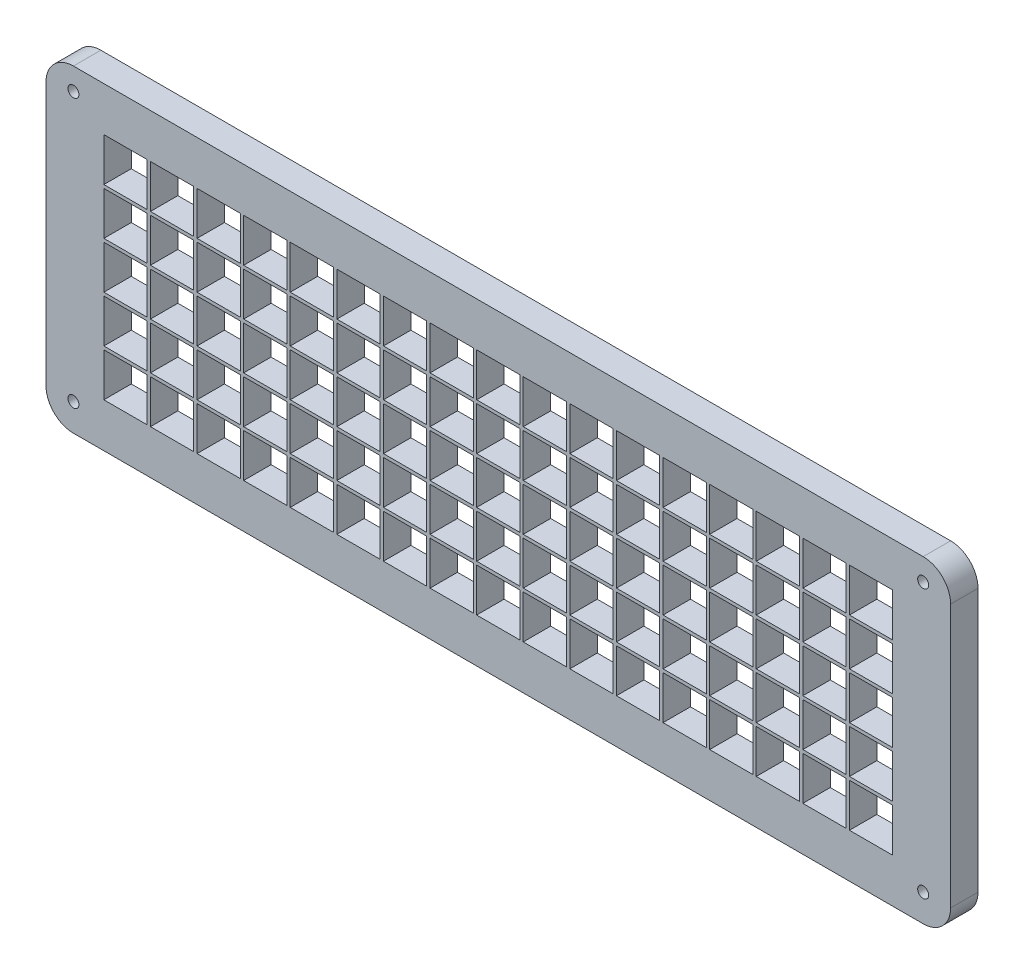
from build123d import *

# Parameters (mm, degrees)
SKETCH_1_W          = 330
SKETCH_1_H          = 116
EXTRUDE_1_DEPTH     = 10
SKETCH_2_W          = 15.8
SKETCH_2_H          = 15.8
CUT_EXTRUDE_3_DEPTH = 176.182761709
FILLET_2_R          = 10
CUT_EXTRUDE_4_DEPTH = 176.182761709


with BuildPart() as part:
    # Sketch 1 → Extrude 1 (new body)
    with BuildSketch(Plane.XY):
        Rectangle(SKETCH_1_W, SKETCH_1_H)
    extrude(amount=EXTRUDE_1_DEPTH)

    # Sketch 2 → Cut-Extrude 3 (cut, through all)
    with BuildSketch(Plane.XY.offset(10)):
        with Locations((-17, 0)):
            Rectangle(SKETCH_2_W, SKETCH_2_H)
        Rectangle(SKETCH_2_W, SKETCH_2_H)
        with Locations((-34, 0)):
            Rectangle(SKETCH_2_W, SKETCH_2_H)
        with Locations((-51, 0)):
            Rectangle(SKETCH_2_W, SKETCH_2_H)
        with Locations((-68, 0)):
            Rectangle(SKETCH_2_W, SKETCH_2_H)
        with Locations((-85, 0)):
            Rectangle(SKETCH_2_W, SKETCH_2_H)
        with Locations((-102, 0)):
            Rectangle(SKETCH_2_W, SKETCH_2_H)
        with Locations((-119, 0)):
            Rectangle(SKETCH_2_W, SKETCH_2_H)
        with Locations((-136, 0)):
            Rectangle(SKETCH_2_W, SKETCH_2_H)
        with Locations((17, 0)):
            Rectangle(SKETCH_2_W, SKETCH_2_H)
        with Locations((34, 0)):
            Rectangle(SKETCH_2_W, SKETCH_2_H)
        with Locations((51, 0)):
            Rectangle(SKETCH_2_W, SKETCH_2_H)
        with Locations((68, 0)):
            Rectangle(SKETCH_2_W, SKETCH_2_H)
        with Locations((85, 0)):
            Rectangle(SKETCH_2_W, SKETCH_2_H)
        with Locations((102, 0)):
            Rectangle(SKETCH_2_W, SKETCH_2_H)
        with Locations((119, 0)):
            Rectangle(SKETCH_2_W, SKETCH_2_H)
        with Locations((136, 0)):
            Rectangle(SKETCH_2_W, SKETCH_2_H)
        with Locations((-17, 17)):
            Rectangle(SKETCH_2_W, SKETCH_2_H)
        with Locations((0, 17)):
            Rectangle(SKETCH_2_W, SKETCH_2_H)
        with Locations((-34, 17)):
            Rectangle(SKETCH_2_W, SKETCH_2_H)
        with Locations((-51, 17)):
            Rectangle(SKETCH_2_W, SKETCH_2_H)
        with Locations((-68, 17)):
            Rectangle(SKETCH_2_W, SKETCH_2_H)
        with Locations((-85, 17)):
            Rectangle(SKETCH_2_W, SKETCH_2_H)
        with Locations((-102, 17)):
            Rectangle(SKETCH_2_W, SKETCH_2_H)
        with Locations((-119, 17)):
            Rectangle(SKETCH_2_W, SKETCH_2_H)
        with Locations((-136, 17)):
            Rectangle(SKETCH_2_W, SKETCH_2_H)
        with Locations((17, 17)):
            Rectangle(SKETCH_2_W, SKETCH_2_H)
        with Locations((34, 17)):
            Rectangle(SKETCH_2_W, SKETCH_2_H)
        with Locations((51, 17)):
            Rectangle(SKETCH_2_W, SKETCH_2_H)
        with Locations((68, 17)):
            Rectangle(SKETCH_2_W, SKETCH_2_H)
        with Locations((85, 17)):
            Rectangle(SKETCH_2_W, SKETCH_2_H)
        with Locations((102, 17)):
            Rectangle(SKETCH_2_W, SKETCH_2_H)
        with Locations((119, 17)):
            Rectangle(SKETCH_2_W, SKETCH_2_H)
        with Locations((136, 17)):
            Rectangle(SKETCH_2_W, SKETCH_2_H)
        with Locations((-17, 34)):
            Rectangle(SKETCH_2_W, SKETCH_2_H)
        with Locations((0, 34)):
            Rectangle(SKETCH_2_W, SKETCH_2_H)
        with Locations((-34, 34)):
            Rectangle(SKETCH_2_W, SKETCH_2_H)
        with Locations((-51, 34)):
            Rectangle(SKETCH_2_W, SKETCH_2_H)
        with Locations((-68, 34)):
            Rectangle(SKETCH_2_W, SKETCH_2_H)
        with Locations((-85, 34)):
            Rectangle(SKETCH_2_W, SKETCH_2_H)
        with Locations((-102, 34)):
            Rectangle(SKETCH_2_W, SKETCH_2_H)
        with Locations((-119, 34)):
            Rectangle(SKETCH_2_W, SKETCH_2_H)
        with Locations((-136, 34)):
            Rectangle(SKETCH_2_W, SKETCH_2_H)
        with Locations((17, 34)):
            Rectangle(SKETCH_2_W, SKETCH_2_H)
        with Locations((34, 34)):
            Rectangle(SKETCH_2_W, SKETCH_2_H)
        with Locations((51, 34)):
            Rectangle(SKETCH_2_W, SKETCH_2_H)
        with Locations((68, 34)):
            Rectangle(SKETCH_2_W, SKETCH_2_H)
        with Locations((85, 34)):
            Rectangle(SKETCH_2_W, SKETCH_2_H)
        with Locations((102, 34)):
            Rectangle(SKETCH_2_W, SKETCH_2_H)
        with Locations((119, 34)):
            Rectangle(SKETCH_2_W, SKETCH_2_H)
        with Locations((136, 34)):
            Rectangle(SKETCH_2_W, SKETCH_2_H)
        with Locations((-17, -17)):
            Rectangle(SKETCH_2_W, SKETCH_2_H)
        with Locations((0, -17)):
            Rectangle(SKETCH_2_W, SKETCH_2_H)
        with Locations((-34, -17)):
            Rectangle(SKETCH_2_W, SKETCH_2_H)
        with Locations((-51, -17)):
            Rectangle(SKETCH_2_W, SKETCH_2_H)
        with Locations((-68, -17)):
            Rectangle(SKETCH_2_W, SKETCH_2_H)
        with Locations((-85, -17)):
            Rectangle(SKETCH_2_W, SKETCH_2_H)
        with Locations((-102, -17)):
            Rectangle(SKETCH_2_W, SKETCH_2_H)
        with Locations((-119, -17)):
            Rectangle(SKETCH_2_W, SKETCH_2_H)
        with Locations((-136, -17)):
            Rectangle(SKETCH_2_W, SKETCH_2_H)
        with Locations((17, -17)):
            Rectangle(SKETCH_2_W, SKETCH_2_H)
        with Locations((34, -17)):
            Rectangle(SKETCH_2_W, SKETCH_2_H)
        with Locations((51, -17)):
            Rectangle(SKETCH_2_W, SKETCH_2_H)
        with Locations((68, -17)):
            Rectangle(SKETCH_2_W, SKETCH_2_H)
        with Locations((85, -17)):
            Rectangle(SKETCH_2_W, SKETCH_2_H)
        with Locations((102, -17)):
            Rectangle(SKETCH_2_W, SKETCH_2_H)
        with Locations((119, -17)):
            Rectangle(SKETCH_2_W, SKETCH_2_H)
        with Locations((136, -17)):
            Rectangle(SKETCH_2_W, SKETCH_2_H)
        with Locations((-17, -34)):
            Rectangle(SKETCH_2_W, SKETCH_2_H)
        with Locations((0, -34)):
            Rectangle(SKETCH_2_W, SKETCH_2_H)
        with Locations((-34, -34)):
            Rectangle(SKETCH_2_W, SKETCH_2_H)
        with Locations((-51, -34)):
            Rectangle(SKETCH_2_W, SKETCH_2_H)
        with Locations((-68, -34)):
            Rectangle(SKETCH_2_W, SKETCH_2_H)
        with Locations((-85, -34)):
            Rectangle(SKETCH_2_W, SKETCH_2_H)
        with Locations((-102, -34)):
            Rectangle(SKETCH_2_W, SKETCH_2_H)
        with Locations((-119, -34)):
            Rectangle(SKETCH_2_W, SKETCH_2_H)
        with Locations((-136, -34)):
            Rectangle(SKETCH_2_W, SKETCH_2_H)
        with Locations((17, -34)):
            Rectangle(SKETCH_2_W, SKETCH_2_H)
        with Locations((34, -34)):
            Rectangle(SKETCH_2_W, SKETCH_2_H)
        with Locations((51, -34)):
            Rectangle(SKETCH_2_W, SKETCH_2_H)
        with Locations((68, -34)):
            Rectangle(SKETCH_2_W, SKETCH_2_H)
        with Locations((85, -34)):
            Rectangle(SKETCH_2_W, SKETCH_2_H)
        with Locations((102, -34)):
            Rectangle(SKETCH_2_W, SKETCH_2_H)
        with Locations((119, -34)):
            Rectangle(SKETCH_2_W, SKETCH_2_H)
        with Locations((136, -34)):
            Rectangle(SKETCH_2_W, SKETCH_2_H)
    extrude(amount=-CUT_EXTRUDE_3_DEPTH, mode=Mode.SUBTRACT)

    # Fillet 2
    fillet_2_edges = [part.edges().sort_by_distance(p)[0] for p in [
        (165, -58, 5),
        (-165, -58, 5),
        (-165, 58, 5),
        (165, 58, 5),
    ]]
    fillet(fillet_2_edges, radius=FILLET_2_R)

    # Sketch 3 → Cut-Extrude 4 (cut, through all)
    with BuildSketch(Plane.XY.offset(10)):
        with BuildLine():
            ThreePointArc((-153, -48), (-153.585786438, -46.585786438), (-155, -46))
            Line((-155, -46), (-155, -48))
            Line((-155, -48), (-153, -48))
        make_face()
        with BuildLine():
            Line((-155, -48), (-155, -46))
            ThreePointArc((-155, -46), (-156.414213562, -49.414213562), (-153, -48))
            Line((-153, -48), (-155, -48))
        make_face()
        with BuildLine():
            ThreePointArc((-153, -48), (-153.585786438, -46.585786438), (-155, -46))
            Line((-155, -46), (-155, -48))
            Line((-155, -48), (-153, -48))
        make_face()
        with BuildLine():
            Line((-155, -48), (-155, -46))
            ThreePointArc((-155, -46), (-156.414213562, -49.414213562), (-153, -48))
            Line((-153, -48), (-155, -48))
        make_face()
        with BuildLine():
            ThreePointArc((-155, 47.948975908), (-153.585062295, 48.535062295), (-152.998975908, 49.95))
            Line((-152.998975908, 49.95), (-155, 49.95))
            Line((-155, 49.95), (-155, 47.948975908))
        make_face()
        with BuildLine():
            Line((-155, 49.95), (-152.998975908, 49.95))
            ThreePointArc((-152.998975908, 49.95), (-156.414937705, 51.364937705), (-155, 47.948975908))
            Line((-155, 47.948975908), (-155, 49.95))
        make_face()
        with BuildLine():
            ThreePointArc((-155, 47.948975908), (-153.585062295, 48.535062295), (-152.998975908, 49.95))
            Line((-152.998975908, 49.95), (-155, 49.95))
            Line((-155, 49.95), (-155, 47.948975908))
        make_face()
        with BuildLine():
            Line((-155, 49.95), (-152.998975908, 49.95))
            ThreePointArc((-152.998975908, 49.95), (-156.414937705, 51.364937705), (-155, 47.948975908))
            Line((-155, 47.948975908), (-155, 49.95))
        make_face()
        with BuildLine():
            ThreePointArc((157, -48), (156.414213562, -46.585786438), (155, -46))
            Line((155, -46), (155, -48))
            Line((155, -48), (153, -48))
            ThreePointArc((153, -48), (155, -50), (157, -48))
        make_face()
        with BuildLine():
            Line((155, -48), (155, -46))
            ThreePointArc((155, -46), (153.585786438, -46.585786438), (153, -48))
            Line((153, -48), (155, -48))
        make_face()
        with BuildLine():
            ThreePointArc((157, -48), (156.414213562, -46.585786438), (155, -46))
            Line((155, -46), (155, -48))
            Line((155, -48), (153, -48))
            ThreePointArc((153, -48), (155, -50), (157, -48))
        make_face()
        with BuildLine():
            Line((155, -48), (155, -46))
            ThreePointArc((155, -46), (153.585786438, -46.585786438), (153, -48))
            Line((153, -48), (155, -48))
        make_face()
        with BuildLine():
            ThreePointArc((157, 49.95), (155, 51.95), (153, 49.95))
            Line((153, 49.95), (155, 49.95))
            Line((155, 49.95), (155, 47.95))
            ThreePointArc((155, 47.95), (156.414213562, 48.535786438), (157, 49.95))
        make_face()
        with BuildLine():
            Line((155, 49.95), (153, 49.95))
            ThreePointArc((153, 49.95), (153.585786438, 48.535786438), (155, 47.95))
            Line((155, 47.95), (155, 49.95))
        make_face()
        with BuildLine():
            ThreePointArc((157, 49.95), (155, 51.95), (153, 49.95))
            Line((153, 49.95), (155, 49.95))
            Line((155, 49.95), (155, 47.95))
            ThreePointArc((155, 47.95), (156.414213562, 48.535786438), (157, 49.95))
        make_face()
        with BuildLine():
            Line((155, 49.95), (153, 49.95))
            ThreePointArc((153, 49.95), (153.585786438, 48.535786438), (155, 47.95))
            Line((155, 47.95), (155, 49.95))
        make_face()
    extrude(amount=-CUT_EXTRUDE_4_DEPTH, mode=Mode.SUBTRACT)


solid = part.part
